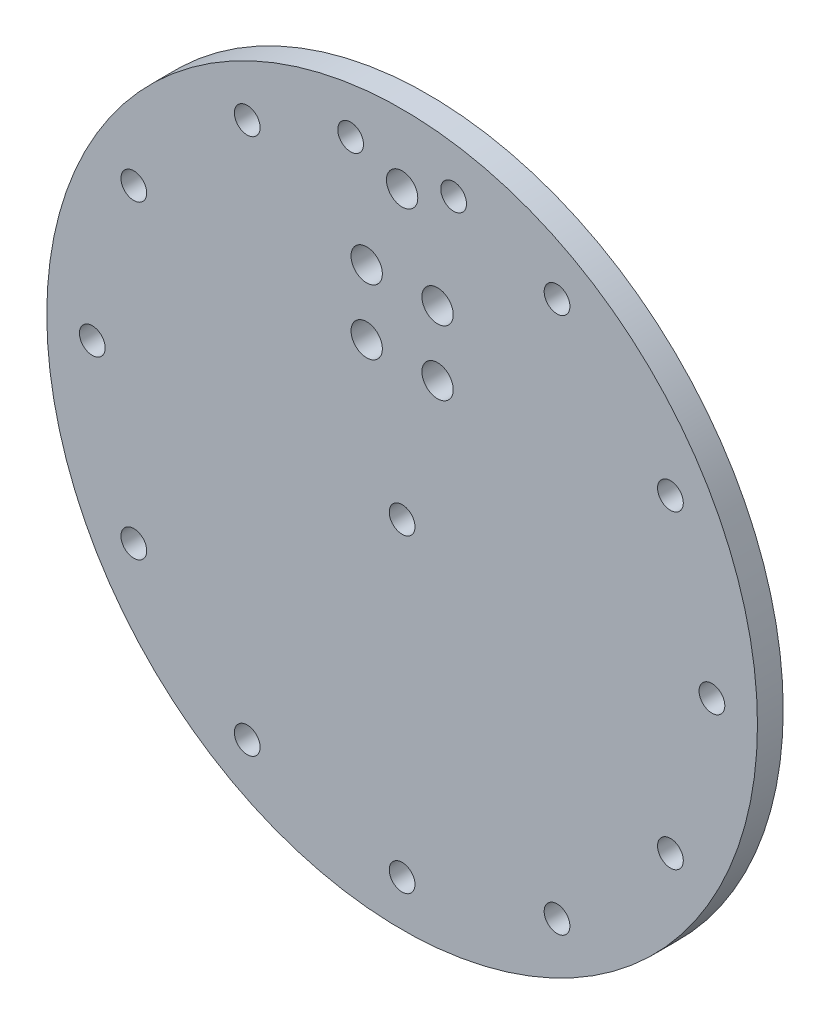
ISO-10303-21;
HEADER;
FILE_DESCRIPTION(('STEP AP214'),'2;1');
FILE_NAME('part.step','',(''),(''),'','','');
FILE_SCHEMA(('AUTOMOTIVE_DESIGN { 1 0 10303 214 1 1 1 1 }'));
ENDSEC;
DATA;
#1=APPLICATION_CONTEXT('core data for automotive mechanical design processes');
#2=APPLICATION_PROTOCOL_DEFINITION('international standard','automotive_design',2000,#1);
#3=PRODUCT_CONTEXT('',#1,'mechanical');
#4=PRODUCT('Part','Part','',(#3));
#5=PRODUCT_RELATED_PRODUCT_CATEGORY('part','',(#4));
#6=PRODUCT_DEFINITION_FORMATION('','',#4);
#7=PRODUCT_DEFINITION_CONTEXT('part definition',#1,'design');
#8=PRODUCT_DEFINITION('design','',#6,#7);
#9=PRODUCT_DEFINITION_SHAPE('','',#8);
#10=(LENGTH_UNIT() NAMED_UNIT(*) SI_UNIT(.MILLI.,.METRE.));
#11=(NAMED_UNIT(*) PLANE_ANGLE_UNIT() SI_UNIT($,.RADIAN.));
#12=(NAMED_UNIT(*) SI_UNIT($,.STERADIAN.) SOLID_ANGLE_UNIT());
#13=UNCERTAINTY_MEASURE_WITH_UNIT(LENGTH_MEASURE(1.E-05),#10,'distance_accuracy_value','');
#14=(GEOMETRIC_REPRESENTATION_CONTEXT(3) GLOBAL_UNCERTAINTY_ASSIGNED_CONTEXT((#13)) GLOBAL_UNIT_ASSIGNED_CONTEXT((#10,
#11,#12)) REPRESENTATION_CONTEXT('',''));
#15=CARTESIAN_POINT('',(0.,0.,0.));
#16=DIRECTION('',(0.,0.,1.));
#17=DIRECTION('',(1.,0.,0.));
#18=AXIS2_PLACEMENT_3D('',#15,#16,#17);
#19=CARTESIAN_POINT('',(0.,0.,3.175));
#20=DIRECTION('',(0.,0.,1.));
#21=DIRECTION('',(1.,0.,0.));
#22=AXIS2_PLACEMENT_3D('',#19,#20,#21);
#23=PLANE('',#22);
#24=CARTESIAN_POINT('',(6.35,37.6685213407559,3.175));
#25=DIRECTION('',(0.,0.,1.));
#26=DIRECTION('',(1.,0.,0.));
#27=AXIS2_PLACEMENT_3D('',#24,#25,#26);
#28=CIRCLE('',#27,1.5875000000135);
#29=CARTESIAN_POINT('',(7.9375000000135,37.6685213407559,3.175));
#30=VERTEX_POINT('',#29);
#31=EDGE_CURVE('E147',#30,#30,#28,.T.);
#32=ORIENTED_EDGE('',*,*,#31,.F.);
#33=EDGE_LOOP('',(#32));
#34=FACE_BOUND('',#33,.T.);
#35=CARTESIAN_POINT('',(4.36880000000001,17.,3.175));
#36=DIRECTION('',(0.,0.,1.));
#37=DIRECTION('',(1.,0.,0.));
#38=AXIS2_PLACEMENT_3D('',#35,#36,#37);
#39=CIRCLE('',#38,1.9304);
#40=CARTESIAN_POINT('',(6.29920000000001,17.,3.175));
#41=VERTEX_POINT('',#40);
#42=EDGE_CURVE('E135',#41,#41,#39,.T.);
#43=ORIENTED_EDGE('',*,*,#42,.F.);
#44=EDGE_LOOP('',(#43));
#45=FACE_BOUND('',#44,.T.);
#46=CARTESIAN_POINT('',(-4.36880000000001,25.,3.175));
#47=DIRECTION('',(0.,0.,1.));
#48=DIRECTION('',(1.,0.,0.));
#49=AXIS2_PLACEMENT_3D('',#46,#47,#48);
#50=CIRCLE('',#49,1.9304);
#51=CARTESIAN_POINT('',(-2.43840000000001,25.,3.175));
#52=VERTEX_POINT('',#51);
#53=EDGE_CURVE('E123',#52,#52,#50,.T.);
#54=ORIENTED_EDGE('',*,*,#53,.F.);
#55=EDGE_LOOP('',(#54));
#56=FACE_BOUND('',#55,.T.);
#57=CARTESIAN_POINT('',(-6.35,37.6685213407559,3.175));
#58=DIRECTION('',(0.,0.,1.));
#59=DIRECTION('',(1.,0.,0.));
#60=AXIS2_PLACEMENT_3D('',#57,#58,#59);
#61=CIRCLE('',#60,1.58750000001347);
#62=CARTESIAN_POINT('',(-4.76249999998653,37.6685213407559,3.175));
#63=VERTEX_POINT('',#62);
#64=EDGE_CURVE('E111',#63,#63,#61,.T.);
#65=ORIENTED_EDGE('',*,*,#64,.F.);
#66=EDGE_LOOP('',(#65));
#67=FACE_BOUND('',#66,.T.);
#68=CARTESIAN_POINT('',(33.0821704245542,19.0999999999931,3.175));
#69=DIRECTION('',(0.,0.,1.));
#70=DIRECTION('',(1.,0.,0.));
#71=AXIS2_PLACEMENT_3D('',#68,#69,#70);
#72=CIRCLE('',#71,1.5875000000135);
#73=CARTESIAN_POINT('',(34.6696704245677,19.0999999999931,3.175));
#74=VERTEX_POINT('',#73);
#75=EDGE_CURVE('E99',#74,#74,#72,.T.);
#76=ORIENTED_EDGE('',*,*,#75,.F.);
#77=EDGE_LOOP('',(#76));
#78=FACE_BOUND('',#77,.T.);
#79=CARTESIAN_POINT('',(-33.082170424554,19.0999999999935,3.175));
#80=DIRECTION('',(0.,0.,1.));
#81=DIRECTION('',(1.,0.,0.));
#82=AXIS2_PLACEMENT_3D('',#79,#80,#81);
#83=CIRCLE('',#82,1.58750000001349);
#84=CARTESIAN_POINT('',(-31.4946704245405,19.0999999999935,3.175));
#85=VERTEX_POINT('',#84);
#86=EDGE_CURVE('E87',#85,#85,#83,.T.);
#87=ORIENTED_EDGE('',*,*,#86,.F.);
#88=EDGE_LOOP('',(#87));
#89=FACE_BOUND('',#88,.T.);
#90=CARTESIAN_POINT('',(38.1999999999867,-4.00123761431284E-13,3.175));
#91=DIRECTION('',(0.,0.,1.));
#92=DIRECTION('',(1.,0.,0.));
#93=AXIS2_PLACEMENT_3D('',#90,#91,#92);
#94=CIRCLE('',#93,1.58750000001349);
#95=CARTESIAN_POINT('',(39.7875000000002,-4.00123761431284E-13,3.175));
#96=VERTEX_POINT('',#95);
#97=EDGE_CURVE('E75',#96,#96,#94,.T.);
#98=ORIENTED_EDGE('',*,*,#97,.F.);
#99=EDGE_LOOP('',(#98));
#100=FACE_BOUND('',#99,.T.);
#101=CARTESIAN_POINT('',(19.0999999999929,-33.0821704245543,3.175));
#102=DIRECTION('',(0.,0.,1.));
#103=DIRECTION('',(1.,0.,0.));
#104=AXIS2_PLACEMENT_3D('',#101,#102,#103);
#105=CIRCLE('',#104,1.58750000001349);
#106=CARTESIAN_POINT('',(20.6875000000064,-33.0821704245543,3.175));
#107=VERTEX_POINT('',#106);
#108=EDGE_CURVE('E63',#107,#107,#105,.T.);
#109=ORIENTED_EDGE('',*,*,#108,.F.);
#110=EDGE_LOOP('',(#109));
#111=FACE_BOUND('',#110,.T.);
#112=CARTESIAN_POINT('',(-19.0999999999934,-33.082170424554,3.175));
#113=DIRECTION('',(0.,0.,1.));
#114=DIRECTION('',(1.,0.,0.));
#115=AXIS2_PLACEMENT_3D('',#112,#113,#114);
#116=CIRCLE('',#115,1.58750000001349);
#117=CARTESIAN_POINT('',(-17.5124999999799,-33.082170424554,3.175));
#118=VERTEX_POINT('',#117);
#119=EDGE_CURVE('E51',#118,#118,#116,.T.);
#120=ORIENTED_EDGE('',*,*,#119,.F.);
#121=EDGE_LOOP('',(#120));
#122=FACE_BOUND('',#121,.T.);
#123=CARTESIAN_POINT('',(0.,0.,3.175));
#124=DIRECTION('',(0.,0.,1.));
#125=DIRECTION('',(1.,0.,0.));
#126=AXIS2_PLACEMENT_3D('',#123,#124,#125);
#127=CIRCLE('',#126,43.815);
#128=CARTESIAN_POINT('',(43.815,0.,3.175));
#129=VERTEX_POINT('',#128);
#130=EDGE_CURVE('E10',#129,#129,#127,.T.);
#131=ORIENTED_EDGE('',*,*,#130,.T.);
#132=EDGE_LOOP('',(#131));
#133=FACE_BOUND('',#132,.T.);
#134=CARTESIAN_POINT('',(-33.0821704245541,-19.0999999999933,3.175));
#135=DIRECTION('',(0.,0.,1.));
#136=DIRECTION('',(1.,0.,0.));
#137=AXIS2_PLACEMENT_3D('',#134,#135,#136);
#138=CIRCLE('',#137,1.58750000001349);
#139=CARTESIAN_POINT('',(-31.4946704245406,-19.0999999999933,3.175));
#140=VERTEX_POINT('',#139);
#141=EDGE_CURVE('E46',#140,#140,#138,.T.);
#142=ORIENTED_EDGE('',*,*,#141,.F.);
#143=EDGE_LOOP('',(#142));
#144=FACE_BOUND('',#143,.T.);
#145=CARTESIAN_POINT('',(0.,-38.1999999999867,3.175));
#146=DIRECTION('',(0.,0.,1.));
#147=DIRECTION('',(1.,0.,0.));
#148=AXIS2_PLACEMENT_3D('',#145,#146,#147);
#149=CIRCLE('',#148,1.58750000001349);
#150=CARTESIAN_POINT('',(1.58750000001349,-38.1999999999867,3.175));
#151=VERTEX_POINT('',#150);
#152=EDGE_CURVE('E57',#151,#151,#149,.T.);
#153=ORIENTED_EDGE('',*,*,#152,.F.);
#154=EDGE_LOOP('',(#153));
#155=FACE_BOUND('',#154,.T.);
#156=CARTESIAN_POINT('',(33.0821704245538,-19.0999999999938,3.175));
#157=DIRECTION('',(0.,0.,1.));
#158=DIRECTION('',(1.,0.,0.));
#159=AXIS2_PLACEMENT_3D('',#156,#157,#158);
#160=CIRCLE('',#159,1.58750000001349);
#161=CARTESIAN_POINT('',(34.6696704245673,-19.0999999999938,3.175));
#162=VERTEX_POINT('',#161);
#163=EDGE_CURVE('E69',#162,#162,#160,.T.);
#164=ORIENTED_EDGE('',*,*,#163,.F.);
#165=EDGE_LOOP('',(#164));
#166=FACE_BOUND('',#165,.T.);
#167=CARTESIAN_POINT('',(-38.1999999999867,1.33374587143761E-13,3.175));
#168=DIRECTION('',(0.,0.,1.));
#169=DIRECTION('',(1.,0.,0.));
#170=AXIS2_PLACEMENT_3D('',#167,#168,#169);
#171=CIRCLE('',#170,1.58750000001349);
#172=CARTESIAN_POINT('',(-36.6124999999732,1.33374587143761E-13,3.175));
#173=VERTEX_POINT('',#172);
#174=EDGE_CURVE('E81',#173,#173,#171,.T.);
#175=ORIENTED_EDGE('',*,*,#174,.F.);
#176=EDGE_LOOP('',(#175));
#177=FACE_BOUND('',#176,.T.);
#178=CARTESIAN_POINT('',(-19.0999999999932,33.0821704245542,3.175));
#179=DIRECTION('',(0.,0.,1.));
#180=DIRECTION('',(1.,0.,0.));
#181=AXIS2_PLACEMENT_3D('',#178,#179,#180);
#182=CIRCLE('',#181,1.5875000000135);
#183=CARTESIAN_POINT('',(-17.5124999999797,33.0821704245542,3.175));
#184=VERTEX_POINT('',#183);
#185=EDGE_CURVE('E93',#184,#184,#182,.T.);
#186=ORIENTED_EDGE('',*,*,#185,.F.);
#187=EDGE_LOOP('',(#186));
#188=FACE_BOUND('',#187,.T.);
#189=CARTESIAN_POINT('',(19.0999999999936,33.0821704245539,3.175));
#190=DIRECTION('',(0.,0.,1.));
#191=DIRECTION('',(1.,0.,0.));
#192=AXIS2_PLACEMENT_3D('',#189,#190,#191);
#193=CIRCLE('',#192,1.58750000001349);
#194=CARTESIAN_POINT('',(20.6875000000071,33.0821704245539,3.175));
#195=VERTEX_POINT('',#194);
#196=EDGE_CURVE('E105',#195,#195,#193,.T.);
#197=ORIENTED_EDGE('',*,*,#196,.F.);
#198=EDGE_LOOP('',(#197));
#199=FACE_BOUND('',#198,.T.);
#200=CARTESIAN_POINT('',(-4.36880000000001,17.,3.175));
#201=DIRECTION('',(0.,0.,1.));
#202=DIRECTION('',(1.,0.,0.));
#203=AXIS2_PLACEMENT_3D('',#200,#201,#202);
#204=CIRCLE('',#203,1.9304);
#205=CARTESIAN_POINT('',(-2.43840000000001,17.,3.175));
#206=VERTEX_POINT('',#205);
#207=EDGE_CURVE('E117',#206,#206,#204,.T.);
#208=ORIENTED_EDGE('',*,*,#207,.F.);
#209=EDGE_LOOP('',(#208));
#210=FACE_BOUND('',#209,.T.);
#211=CARTESIAN_POINT('',(4.36880000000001,25.,3.175));
#212=DIRECTION('',(0.,0.,1.));
#213=DIRECTION('',(1.,0.,0.));
#214=AXIS2_PLACEMENT_3D('',#211,#212,#213);
#215=CIRCLE('',#214,1.9304);
#216=CARTESIAN_POINT('',(6.29920000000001,25.,3.175));
#217=VERTEX_POINT('',#216);
#218=EDGE_CURVE('E129',#217,#217,#215,.T.);
#219=ORIENTED_EDGE('',*,*,#218,.F.);
#220=EDGE_LOOP('',(#219));
#221=FACE_BOUND('',#220,.T.);
#222=CARTESIAN_POINT('',(0.,35.2924110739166,3.175));
#223=DIRECTION('',(0.,0.,1.));
#224=DIRECTION('',(1.,0.,0.));
#225=AXIS2_PLACEMENT_3D('',#222,#223,#224);
#226=CIRCLE('',#225,1.9304);
#227=CARTESIAN_POINT('',(1.9304,35.2924110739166,3.175));
#228=VERTEX_POINT('',#227);
#229=EDGE_CURVE('E141',#228,#228,#226,.T.);
#230=ORIENTED_EDGE('',*,*,#229,.F.);
#231=EDGE_LOOP('',(#230));
#232=FACE_BOUND('',#231,.T.);
#233=CARTESIAN_POINT('',(0.,0.,3.175));
#234=DIRECTION('',(0.,0.,1.));
#235=DIRECTION('',(1.,0.,0.));
#236=AXIS2_PLACEMENT_3D('',#233,#234,#235);
#237=CIRCLE('',#236,1.5875);
#238=CARTESIAN_POINT('',(1.5875,0.,3.175));
#239=VERTEX_POINT('',#238);
#240=EDGE_CURVE('E153',#239,#239,#237,.T.);
#241=ORIENTED_EDGE('',*,*,#240,.F.);
#242=EDGE_LOOP('',(#241));
#243=FACE_BOUND('',#242,.T.);
#244=ADVANCED_FACE('F35',(#34,#45,#56,#67,#78,#89,#100,#111,#122,#133,#144,#155,#166,#177,#188,
#199,#210,#221,#232,#243),#23,.T.);
#245=CARTESIAN_POINT('',(0.,0.,0.));
#246=DIRECTION('',(0.,0.,1.));
#247=DIRECTION('',(1.,0.,0.));
#248=AXIS2_PLACEMENT_3D('',#245,#246,#247);
#249=PLANE('',#248);
#250=CARTESIAN_POINT('',(0.,0.,0.));
#251=DIRECTION('',(0.,0.,1.));
#252=DIRECTION('',(1.,0.,0.));
#253=AXIS2_PLACEMENT_3D('',#250,#251,#252);
#254=CIRCLE('',#253,43.815);
#255=CARTESIAN_POINT('',(43.815,0.,0.));
#256=VERTEX_POINT('',#255);
#257=EDGE_CURVE('E39',#256,#256,#254,.T.);
#258=ORIENTED_EDGE('',*,*,#257,.F.);
#259=EDGE_LOOP('',(#258));
#260=FACE_BOUND('',#259,.T.);
#261=CARTESIAN_POINT('',(-33.0821704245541,-19.0999999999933,0.));
#262=DIRECTION('',(0.,0.,1.));
#263=DIRECTION('',(1.,0.,0.));
#264=AXIS2_PLACEMENT_3D('',#261,#262,#263);
#265=CIRCLE('',#264,1.58750000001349);
#266=CARTESIAN_POINT('',(-31.4946704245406,-19.0999999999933,0.));
#267=VERTEX_POINT('',#266);
#268=EDGE_CURVE('E48',#267,#267,#265,.T.);
#269=ORIENTED_EDGE('',*,*,#268,.T.);
#270=EDGE_LOOP('',(#269));
#271=FACE_BOUND('',#270,.T.);
#272=CARTESIAN_POINT('',(-19.0999999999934,-33.082170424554,0.));
#273=DIRECTION('',(0.,0.,1.));
#274=DIRECTION('',(1.,0.,0.));
#275=AXIS2_PLACEMENT_3D('',#272,#273,#274);
#276=CIRCLE('',#275,1.58750000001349);
#277=CARTESIAN_POINT('',(-17.5124999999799,-33.082170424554,0.));
#278=VERTEX_POINT('',#277);
#279=EDGE_CURVE('E54',#278,#278,#276,.T.);
#280=ORIENTED_EDGE('',*,*,#279,.T.);
#281=EDGE_LOOP('',(#280));
#282=FACE_BOUND('',#281,.T.);
#283=CARTESIAN_POINT('',(0.,-38.1999999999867,0.));
#284=DIRECTION('',(0.,0.,1.));
#285=DIRECTION('',(1.,0.,0.));
#286=AXIS2_PLACEMENT_3D('',#283,#284,#285);
#287=CIRCLE('',#286,1.58750000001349);
#288=CARTESIAN_POINT('',(1.58750000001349,-38.1999999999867,0.));
#289=VERTEX_POINT('',#288);
#290=EDGE_CURVE('E60',#289,#289,#287,.T.);
#291=ORIENTED_EDGE('',*,*,#290,.T.);
#292=EDGE_LOOP('',(#291));
#293=FACE_BOUND('',#292,.T.);
#294=CARTESIAN_POINT('',(19.0999999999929,-33.0821704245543,0.));
#295=DIRECTION('',(0.,0.,1.));
#296=DIRECTION('',(1.,0.,0.));
#297=AXIS2_PLACEMENT_3D('',#294,#295,#296);
#298=CIRCLE('',#297,1.58750000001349);
#299=CARTESIAN_POINT('',(20.6875000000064,-33.0821704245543,0.));
#300=VERTEX_POINT('',#299);
#301=EDGE_CURVE('E66',#300,#300,#298,.T.);
#302=ORIENTED_EDGE('',*,*,#301,.T.);
#303=EDGE_LOOP('',(#302));
#304=FACE_BOUND('',#303,.T.);
#305=CARTESIAN_POINT('',(33.0821704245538,-19.0999999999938,0.));
#306=DIRECTION('',(0.,0.,1.));
#307=DIRECTION('',(1.,0.,0.));
#308=AXIS2_PLACEMENT_3D('',#305,#306,#307);
#309=CIRCLE('',#308,1.58750000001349);
#310=CARTESIAN_POINT('',(34.6696704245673,-19.0999999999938,0.));
#311=VERTEX_POINT('',#310);
#312=EDGE_CURVE('E72',#311,#311,#309,.T.);
#313=ORIENTED_EDGE('',*,*,#312,.T.);
#314=EDGE_LOOP('',(#313));
#315=FACE_BOUND('',#314,.T.);
#316=CARTESIAN_POINT('',(38.1999999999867,-4.00123761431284E-13,0.));
#317=DIRECTION('',(0.,0.,1.));
#318=DIRECTION('',(1.,0.,0.));
#319=AXIS2_PLACEMENT_3D('',#316,#317,#318);
#320=CIRCLE('',#319,1.58750000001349);
#321=CARTESIAN_POINT('',(39.7875000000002,-4.00123761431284E-13,0.));
#322=VERTEX_POINT('',#321);
#323=EDGE_CURVE('E78',#322,#322,#320,.T.);
#324=ORIENTED_EDGE('',*,*,#323,.T.);
#325=EDGE_LOOP('',(#324));
#326=FACE_BOUND('',#325,.T.);
#327=CARTESIAN_POINT('',(-38.1999999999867,1.33374587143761E-13,0.));
#328=DIRECTION('',(0.,0.,1.));
#329=DIRECTION('',(1.,0.,0.));
#330=AXIS2_PLACEMENT_3D('',#327,#328,#329);
#331=CIRCLE('',#330,1.58750000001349);
#332=CARTESIAN_POINT('',(-36.6124999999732,1.33374587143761E-13,0.));
#333=VERTEX_POINT('',#332);
#334=EDGE_CURVE('E84',#333,#333,#331,.T.);
#335=ORIENTED_EDGE('',*,*,#334,.T.);
#336=EDGE_LOOP('',(#335));
#337=FACE_BOUND('',#336,.T.);
#338=CARTESIAN_POINT('',(-33.082170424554,19.0999999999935,0.));
#339=DIRECTION('',(0.,0.,1.));
#340=DIRECTION('',(1.,0.,0.));
#341=AXIS2_PLACEMENT_3D('',#338,#339,#340);
#342=CIRCLE('',#341,1.58750000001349);
#343=CARTESIAN_POINT('',(-31.4946704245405,19.0999999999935,0.));
#344=VERTEX_POINT('',#343);
#345=EDGE_CURVE('E90',#344,#344,#342,.T.);
#346=ORIENTED_EDGE('',*,*,#345,.T.);
#347=EDGE_LOOP('',(#346));
#348=FACE_BOUND('',#347,.T.);
#349=CARTESIAN_POINT('',(-19.0999999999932,33.0821704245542,0.));
#350=DIRECTION('',(0.,0.,1.));
#351=DIRECTION('',(1.,0.,0.));
#352=AXIS2_PLACEMENT_3D('',#349,#350,#351);
#353=CIRCLE('',#352,1.5875000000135);
#354=CARTESIAN_POINT('',(-17.5124999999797,33.0821704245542,0.));
#355=VERTEX_POINT('',#354);
#356=EDGE_CURVE('E96',#355,#355,#353,.T.);
#357=ORIENTED_EDGE('',*,*,#356,.T.);
#358=EDGE_LOOP('',(#357));
#359=FACE_BOUND('',#358,.T.);
#360=CARTESIAN_POINT('',(33.0821704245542,19.0999999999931,0.));
#361=DIRECTION('',(0.,0.,1.));
#362=DIRECTION('',(1.,0.,0.));
#363=AXIS2_PLACEMENT_3D('',#360,#361,#362);
#364=CIRCLE('',#363,1.5875000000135);
#365=CARTESIAN_POINT('',(34.6696704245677,19.0999999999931,0.));
#366=VERTEX_POINT('',#365);
#367=EDGE_CURVE('E102',#366,#366,#364,.T.);
#368=ORIENTED_EDGE('',*,*,#367,.T.);
#369=EDGE_LOOP('',(#368));
#370=FACE_BOUND('',#369,.T.);
#371=CARTESIAN_POINT('',(19.0999999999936,33.0821704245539,0.));
#372=DIRECTION('',(0.,0.,1.));
#373=DIRECTION('',(1.,0.,0.));
#374=AXIS2_PLACEMENT_3D('',#371,#372,#373);
#375=CIRCLE('',#374,1.58750000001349);
#376=CARTESIAN_POINT('',(20.6875000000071,33.0821704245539,0.));
#377=VERTEX_POINT('',#376);
#378=EDGE_CURVE('E108',#377,#377,#375,.T.);
#379=ORIENTED_EDGE('',*,*,#378,.T.);
#380=EDGE_LOOP('',(#379));
#381=FACE_BOUND('',#380,.T.);
#382=CARTESIAN_POINT('',(-6.35,37.6685213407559,0.));
#383=DIRECTION('',(0.,0.,1.));
#384=DIRECTION('',(1.,0.,0.));
#385=AXIS2_PLACEMENT_3D('',#382,#383,#384);
#386=CIRCLE('',#385,1.58750000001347);
#387=CARTESIAN_POINT('',(-4.76249999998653,37.6685213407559,0.));
#388=VERTEX_POINT('',#387);
#389=EDGE_CURVE('E114',#388,#388,#386,.T.);
#390=ORIENTED_EDGE('',*,*,#389,.T.);
#391=EDGE_LOOP('',(#390));
#392=FACE_BOUND('',#391,.T.);
#393=CARTESIAN_POINT('',(-4.36880000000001,17.,0.));
#394=DIRECTION('',(0.,0.,1.));
#395=DIRECTION('',(1.,0.,0.));
#396=AXIS2_PLACEMENT_3D('',#393,#394,#395);
#397=CIRCLE('',#396,1.9304);
#398=CARTESIAN_POINT('',(-2.43840000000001,17.,0.));
#399=VERTEX_POINT('',#398);
#400=EDGE_CURVE('E120',#399,#399,#397,.T.);
#401=ORIENTED_EDGE('',*,*,#400,.T.);
#402=EDGE_LOOP('',(#401));
#403=FACE_BOUND('',#402,.T.);
#404=CARTESIAN_POINT('',(-4.36880000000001,25.,0.));
#405=DIRECTION('',(0.,0.,1.));
#406=DIRECTION('',(1.,0.,0.));
#407=AXIS2_PLACEMENT_3D('',#404,#405,#406);
#408=CIRCLE('',#407,1.9304);
#409=CARTESIAN_POINT('',(-2.43840000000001,25.,0.));
#410=VERTEX_POINT('',#409);
#411=EDGE_CURVE('E126',#410,#410,#408,.T.);
#412=ORIENTED_EDGE('',*,*,#411,.T.);
#413=EDGE_LOOP('',(#412));
#414=FACE_BOUND('',#413,.T.);
#415=CARTESIAN_POINT('',(4.36880000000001,25.,0.));
#416=DIRECTION('',(0.,0.,1.));
#417=DIRECTION('',(1.,0.,0.));
#418=AXIS2_PLACEMENT_3D('',#415,#416,#417);
#419=CIRCLE('',#418,1.9304);
#420=CARTESIAN_POINT('',(6.29920000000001,25.,0.));
#421=VERTEX_POINT('',#420);
#422=EDGE_CURVE('E132',#421,#421,#419,.T.);
#423=ORIENTED_EDGE('',*,*,#422,.T.);
#424=EDGE_LOOP('',(#423));
#425=FACE_BOUND('',#424,.T.);
#426=CARTESIAN_POINT('',(4.36880000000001,17.,0.));
#427=DIRECTION('',(0.,0.,1.));
#428=DIRECTION('',(1.,0.,0.));
#429=AXIS2_PLACEMENT_3D('',#426,#427,#428);
#430=CIRCLE('',#429,1.9304);
#431=CARTESIAN_POINT('',(6.29920000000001,17.,0.));
#432=VERTEX_POINT('',#431);
#433=EDGE_CURVE('E138',#432,#432,#430,.T.);
#434=ORIENTED_EDGE('',*,*,#433,.T.);
#435=EDGE_LOOP('',(#434));
#436=FACE_BOUND('',#435,.T.);
#437=CARTESIAN_POINT('',(0.,35.2924110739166,0.));
#438=DIRECTION('',(0.,0.,1.));
#439=DIRECTION('',(1.,0.,0.));
#440=AXIS2_PLACEMENT_3D('',#437,#438,#439);
#441=CIRCLE('',#440,1.9304);
#442=CARTESIAN_POINT('',(1.9304,35.2924110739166,0.));
#443=VERTEX_POINT('',#442);
#444=EDGE_CURVE('E144',#443,#443,#441,.T.);
#445=ORIENTED_EDGE('',*,*,#444,.T.);
#446=EDGE_LOOP('',(#445));
#447=FACE_BOUND('',#446,.T.);
#448=CARTESIAN_POINT('',(6.35,37.6685213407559,0.));
#449=DIRECTION('',(0.,0.,1.));
#450=DIRECTION('',(1.,0.,0.));
#451=AXIS2_PLACEMENT_3D('',#448,#449,#450);
#452=CIRCLE('',#451,1.5875000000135);
#453=CARTESIAN_POINT('',(7.9375000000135,37.6685213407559,0.));
#454=VERTEX_POINT('',#453);
#455=EDGE_CURVE('E150',#454,#454,#452,.T.);
#456=ORIENTED_EDGE('',*,*,#455,.T.);
#457=EDGE_LOOP('',(#456));
#458=FACE_BOUND('',#457,.T.);
#459=CARTESIAN_POINT('',(0.,0.,0.));
#460=DIRECTION('',(0.,0.,1.));
#461=DIRECTION('',(1.,0.,0.));
#462=AXIS2_PLACEMENT_3D('',#459,#460,#461);
#463=CIRCLE('',#462,1.5875);
#464=CARTESIAN_POINT('',(1.5875,0.,0.));
#465=VERTEX_POINT('',#464);
#466=EDGE_CURVE('E156',#465,#465,#463,.T.);
#467=ORIENTED_EDGE('',*,*,#466,.T.);
#468=EDGE_LOOP('',(#467));
#469=FACE_BOUND('',#468,.T.);
#470=ADVANCED_FACE('F166',(#260,#271,#282,#293,#304,#315,#326,#337,#348,#359,#370,#381,#392,
#403,#414,#425,#436,#447,#458,#469),#249,.F.);
#471=CARTESIAN_POINT('',(0.,0.,3.175));
#472=DIRECTION('',(0.,0.,-1.));
#473=DIRECTION('',(-1.,0.,0.));
#474=AXIS2_PLACEMENT_3D('',#471,#472,#473);
#475=CYLINDRICAL_SURFACE('',#474,43.815);
#476=ORIENTED_EDGE('',*,*,#130,.F.);
#477=EDGE_LOOP('',(#476));
#478=FACE_BOUND('',#477,.T.);
#479=ORIENTED_EDGE('',*,*,#257,.T.);
#480=EDGE_LOOP('',(#479));
#481=FACE_BOUND('',#480,.T.);
#482=ADVANCED_FACE('F37',(#478,#481),#475,.T.);
#483=CARTESIAN_POINT('',(-33.0821704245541,-19.0999999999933,3.175));
#484=DIRECTION('',(0.,0.,-1.));
#485=DIRECTION('',(-1.,0.,0.));
#486=AXIS2_PLACEMENT_3D('',#483,#484,#485);
#487=CYLINDRICAL_SURFACE('',#486,1.58750000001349);
#488=ORIENTED_EDGE('',*,*,#141,.T.);
#489=EDGE_LOOP('',(#488));
#490=FACE_BOUND('',#489,.T.);
#491=ORIENTED_EDGE('',*,*,#268,.F.);
#492=EDGE_LOOP('',(#491));
#493=FACE_BOUND('',#492,.T.);
#494=ADVANCED_FACE('F176',(#490,#493),#487,.F.);
#495=CARTESIAN_POINT('',(-19.0999999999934,-33.082170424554,3.175));
#496=DIRECTION('',(0.,0.,-1.));
#497=DIRECTION('',(-1.,0.,0.));
#498=AXIS2_PLACEMENT_3D('',#495,#496,#497);
#499=CYLINDRICAL_SURFACE('',#498,1.58750000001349);
#500=ORIENTED_EDGE('',*,*,#119,.T.);
#501=EDGE_LOOP('',(#500));
#502=FACE_BOUND('',#501,.T.);
#503=ORIENTED_EDGE('',*,*,#279,.F.);
#504=EDGE_LOOP('',(#503));
#505=FACE_BOUND('',#504,.T.);
#506=ADVANCED_FACE('F179',(#502,#505),#499,.F.);
#507=CARTESIAN_POINT('',(0.,-38.1999999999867,3.175));
#508=DIRECTION('',(0.,0.,-1.));
#509=DIRECTION('',(-1.,0.,0.));
#510=AXIS2_PLACEMENT_3D('',#507,#508,#509);
#511=CYLINDRICAL_SURFACE('',#510,1.58750000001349);
#512=ORIENTED_EDGE('',*,*,#152,.T.);
#513=EDGE_LOOP('',(#512));
#514=FACE_BOUND('',#513,.T.);
#515=ORIENTED_EDGE('',*,*,#290,.F.);
#516=EDGE_LOOP('',(#515));
#517=FACE_BOUND('',#516,.T.);
#518=ADVANCED_FACE('F183',(#514,#517),#511,.F.);
#519=CARTESIAN_POINT('',(19.0999999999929,-33.0821704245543,3.175));
#520=DIRECTION('',(0.,0.,-1.));
#521=DIRECTION('',(-1.,0.,0.));
#522=AXIS2_PLACEMENT_3D('',#519,#520,#521);
#523=CYLINDRICAL_SURFACE('',#522,1.58750000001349);
#524=ORIENTED_EDGE('',*,*,#108,.T.);
#525=EDGE_LOOP('',(#524));
#526=FACE_BOUND('',#525,.T.);
#527=ORIENTED_EDGE('',*,*,#301,.F.);
#528=EDGE_LOOP('',(#527));
#529=FACE_BOUND('',#528,.T.);
#530=ADVANCED_FACE('F187',(#526,#529),#523,.F.);
#531=CARTESIAN_POINT('',(33.0821704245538,-19.0999999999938,3.175));
#532=DIRECTION('',(0.,0.,-1.));
#533=DIRECTION('',(-1.,0.,0.));
#534=AXIS2_PLACEMENT_3D('',#531,#532,#533);
#535=CYLINDRICAL_SURFACE('',#534,1.58750000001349);
#536=ORIENTED_EDGE('',*,*,#163,.T.);
#537=EDGE_LOOP('',(#536));
#538=FACE_BOUND('',#537,.T.);
#539=ORIENTED_EDGE('',*,*,#312,.F.);
#540=EDGE_LOOP('',(#539));
#541=FACE_BOUND('',#540,.T.);
#542=ADVANCED_FACE('F191',(#538,#541),#535,.F.);
#543=CARTESIAN_POINT('',(38.1999999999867,-4.00123761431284E-13,3.175));
#544=DIRECTION('',(0.,0.,-1.));
#545=DIRECTION('',(-1.,0.,0.));
#546=AXIS2_PLACEMENT_3D('',#543,#544,#545);
#547=CYLINDRICAL_SURFACE('',#546,1.58750000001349);
#548=ORIENTED_EDGE('',*,*,#97,.T.);
#549=EDGE_LOOP('',(#548));
#550=FACE_BOUND('',#549,.T.);
#551=ORIENTED_EDGE('',*,*,#323,.F.);
#552=EDGE_LOOP('',(#551));
#553=FACE_BOUND('',#552,.T.);
#554=ADVANCED_FACE('F195',(#550,#553),#547,.F.);
#555=CARTESIAN_POINT('',(-38.1999999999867,1.33374587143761E-13,3.175));
#556=DIRECTION('',(0.,0.,-1.));
#557=DIRECTION('',(-1.,0.,0.));
#558=AXIS2_PLACEMENT_3D('',#555,#556,#557);
#559=CYLINDRICAL_SURFACE('',#558,1.58750000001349);
#560=ORIENTED_EDGE('',*,*,#174,.T.);
#561=EDGE_LOOP('',(#560));
#562=FACE_BOUND('',#561,.T.);
#563=ORIENTED_EDGE('',*,*,#334,.F.);
#564=EDGE_LOOP('',(#563));
#565=FACE_BOUND('',#564,.T.);
#566=ADVANCED_FACE('F199',(#562,#565),#559,.F.);
#567=CARTESIAN_POINT('',(-33.082170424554,19.0999999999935,3.175));
#568=DIRECTION('',(0.,0.,-1.));
#569=DIRECTION('',(-1.,0.,0.));
#570=AXIS2_PLACEMENT_3D('',#567,#568,#569);
#571=CYLINDRICAL_SURFACE('',#570,1.58750000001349);
#572=ORIENTED_EDGE('',*,*,#86,.T.);
#573=EDGE_LOOP('',(#572));
#574=FACE_BOUND('',#573,.T.);
#575=ORIENTED_EDGE('',*,*,#345,.F.);
#576=EDGE_LOOP('',(#575));
#577=FACE_BOUND('',#576,.T.);
#578=ADVANCED_FACE('F203',(#574,#577),#571,.F.);
#579=CARTESIAN_POINT('',(-19.0999999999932,33.0821704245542,3.175));
#580=DIRECTION('',(0.,0.,-1.));
#581=DIRECTION('',(-1.,0.,0.));
#582=AXIS2_PLACEMENT_3D('',#579,#580,#581);
#583=CYLINDRICAL_SURFACE('',#582,1.5875000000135);
#584=ORIENTED_EDGE('',*,*,#185,.T.);
#585=EDGE_LOOP('',(#584));
#586=FACE_BOUND('',#585,.T.);
#587=ORIENTED_EDGE('',*,*,#356,.F.);
#588=EDGE_LOOP('',(#587));
#589=FACE_BOUND('',#588,.T.);
#590=ADVANCED_FACE('F207',(#586,#589),#583,.F.);
#591=CARTESIAN_POINT('',(33.0821704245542,19.0999999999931,3.175));
#592=DIRECTION('',(0.,0.,-1.));
#593=DIRECTION('',(-1.,0.,0.));
#594=AXIS2_PLACEMENT_3D('',#591,#592,#593);
#595=CYLINDRICAL_SURFACE('',#594,1.5875000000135);
#596=ORIENTED_EDGE('',*,*,#75,.T.);
#597=EDGE_LOOP('',(#596));
#598=FACE_BOUND('',#597,.T.);
#599=ORIENTED_EDGE('',*,*,#367,.F.);
#600=EDGE_LOOP('',(#599));
#601=FACE_BOUND('',#600,.T.);
#602=ADVANCED_FACE('F211',(#598,#601),#595,.F.);
#603=CARTESIAN_POINT('',(19.0999999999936,33.0821704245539,3.175));
#604=DIRECTION('',(0.,0.,-1.));
#605=DIRECTION('',(-1.,0.,0.));
#606=AXIS2_PLACEMENT_3D('',#603,#604,#605);
#607=CYLINDRICAL_SURFACE('',#606,1.58750000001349);
#608=ORIENTED_EDGE('',*,*,#196,.T.);
#609=EDGE_LOOP('',(#608));
#610=FACE_BOUND('',#609,.T.);
#611=ORIENTED_EDGE('',*,*,#378,.F.);
#612=EDGE_LOOP('',(#611));
#613=FACE_BOUND('',#612,.T.);
#614=ADVANCED_FACE('F215',(#610,#613),#607,.F.);
#615=CARTESIAN_POINT('',(-6.35,37.6685213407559,3.175));
#616=DIRECTION('',(0.,0.,-1.));
#617=DIRECTION('',(-1.,0.,0.));
#618=AXIS2_PLACEMENT_3D('',#615,#616,#617);
#619=CYLINDRICAL_SURFACE('',#618,1.58750000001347);
#620=ORIENTED_EDGE('',*,*,#64,.T.);
#621=EDGE_LOOP('',(#620));
#622=FACE_BOUND('',#621,.T.);
#623=ORIENTED_EDGE('',*,*,#389,.F.);
#624=EDGE_LOOP('',(#623));
#625=FACE_BOUND('',#624,.T.);
#626=ADVANCED_FACE('F219',(#622,#625),#619,.F.);
#627=CARTESIAN_POINT('',(-4.36880000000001,17.,3.175));
#628=DIRECTION('',(0.,0.,-1.));
#629=DIRECTION('',(-1.,0.,0.));
#630=AXIS2_PLACEMENT_3D('',#627,#628,#629);
#631=CYLINDRICAL_SURFACE('',#630,1.9304);
#632=ORIENTED_EDGE('',*,*,#207,.T.);
#633=EDGE_LOOP('',(#632));
#634=FACE_BOUND('',#633,.T.);
#635=ORIENTED_EDGE('',*,*,#400,.F.);
#636=EDGE_LOOP('',(#635));
#637=FACE_BOUND('',#636,.T.);
#638=ADVANCED_FACE('F223',(#634,#637),#631,.F.);
#639=CARTESIAN_POINT('',(-4.36880000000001,25.,3.175));
#640=DIRECTION('',(0.,0.,-1.));
#641=DIRECTION('',(-1.,0.,0.));
#642=AXIS2_PLACEMENT_3D('',#639,#640,#641);
#643=CYLINDRICAL_SURFACE('',#642,1.9304);
#644=ORIENTED_EDGE('',*,*,#53,.T.);
#645=EDGE_LOOP('',(#644));
#646=FACE_BOUND('',#645,.T.);
#647=ORIENTED_EDGE('',*,*,#411,.F.);
#648=EDGE_LOOP('',(#647));
#649=FACE_BOUND('',#648,.T.);
#650=ADVANCED_FACE('F227',(#646,#649),#643,.F.);
#651=CARTESIAN_POINT('',(4.36880000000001,25.,3.175));
#652=DIRECTION('',(0.,0.,-1.));
#653=DIRECTION('',(-1.,0.,0.));
#654=AXIS2_PLACEMENT_3D('',#651,#652,#653);
#655=CYLINDRICAL_SURFACE('',#654,1.9304);
#656=ORIENTED_EDGE('',*,*,#218,.T.);
#657=EDGE_LOOP('',(#656));
#658=FACE_BOUND('',#657,.T.);
#659=ORIENTED_EDGE('',*,*,#422,.F.);
#660=EDGE_LOOP('',(#659));
#661=FACE_BOUND('',#660,.T.);
#662=ADVANCED_FACE('F231',(#658,#661),#655,.F.);
#663=CARTESIAN_POINT('',(4.36880000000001,17.,3.175));
#664=DIRECTION('',(0.,0.,-1.));
#665=DIRECTION('',(-1.,0.,0.));
#666=AXIS2_PLACEMENT_3D('',#663,#664,#665);
#667=CYLINDRICAL_SURFACE('',#666,1.9304);
#668=ORIENTED_EDGE('',*,*,#42,.T.);
#669=EDGE_LOOP('',(#668));
#670=FACE_BOUND('',#669,.T.);
#671=ORIENTED_EDGE('',*,*,#433,.F.);
#672=EDGE_LOOP('',(#671));
#673=FACE_BOUND('',#672,.T.);
#674=ADVANCED_FACE('F235',(#670,#673),#667,.F.);
#675=CARTESIAN_POINT('',(0.,35.2924110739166,3.175));
#676=DIRECTION('',(0.,0.,-1.));
#677=DIRECTION('',(-1.,0.,0.));
#678=AXIS2_PLACEMENT_3D('',#675,#676,#677);
#679=CYLINDRICAL_SURFACE('',#678,1.9304);
#680=ORIENTED_EDGE('',*,*,#229,.T.);
#681=EDGE_LOOP('',(#680));
#682=FACE_BOUND('',#681,.T.);
#683=ORIENTED_EDGE('',*,*,#444,.F.);
#684=EDGE_LOOP('',(#683));
#685=FACE_BOUND('',#684,.T.);
#686=ADVANCED_FACE('F239',(#682,#685),#679,.F.);
#687=CARTESIAN_POINT('',(6.35,37.6685213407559,3.175));
#688=DIRECTION('',(0.,0.,-1.));
#689=DIRECTION('',(-1.,0.,0.));
#690=AXIS2_PLACEMENT_3D('',#687,#688,#689);
#691=CYLINDRICAL_SURFACE('',#690,1.5875000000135);
#692=ORIENTED_EDGE('',*,*,#31,.T.);
#693=EDGE_LOOP('',(#692));
#694=FACE_BOUND('',#693,.T.);
#695=ORIENTED_EDGE('',*,*,#455,.F.);
#696=EDGE_LOOP('',(#695));
#697=FACE_BOUND('',#696,.T.);
#698=ADVANCED_FACE('F243',(#694,#697),#691,.F.);
#699=CARTESIAN_POINT('',(0.,0.,3.175));
#700=DIRECTION('',(0.,0.,-1.));
#701=DIRECTION('',(-1.,0.,0.));
#702=AXIS2_PLACEMENT_3D('',#699,#700,#701);
#703=CYLINDRICAL_SURFACE('',#702,1.5875);
#704=ORIENTED_EDGE('',*,*,#240,.T.);
#705=EDGE_LOOP('',(#704));
#706=FACE_BOUND('',#705,.T.);
#707=ORIENTED_EDGE('',*,*,#466,.F.);
#708=EDGE_LOOP('',(#707));
#709=FACE_BOUND('',#708,.T.);
#710=ADVANCED_FACE('F162',(#706,#709),#703,.F.);
#711=CLOSED_SHELL('',(#244,#470,#482,#494,#506,#518,#530,#542,#554,#566,#578,#590,#602,#614,
#626,#638,#650,#662,#674,#686,#698,#710));
#712=MANIFOLD_SOLID_BREP('B2',#711);
#713=ADVANCED_BREP_SHAPE_REPRESENTATION('',(#18,#712),#14);
#714=SHAPE_DEFINITION_REPRESENTATION(#9,#713);
ENDSEC;
END-ISO-10303-21;
